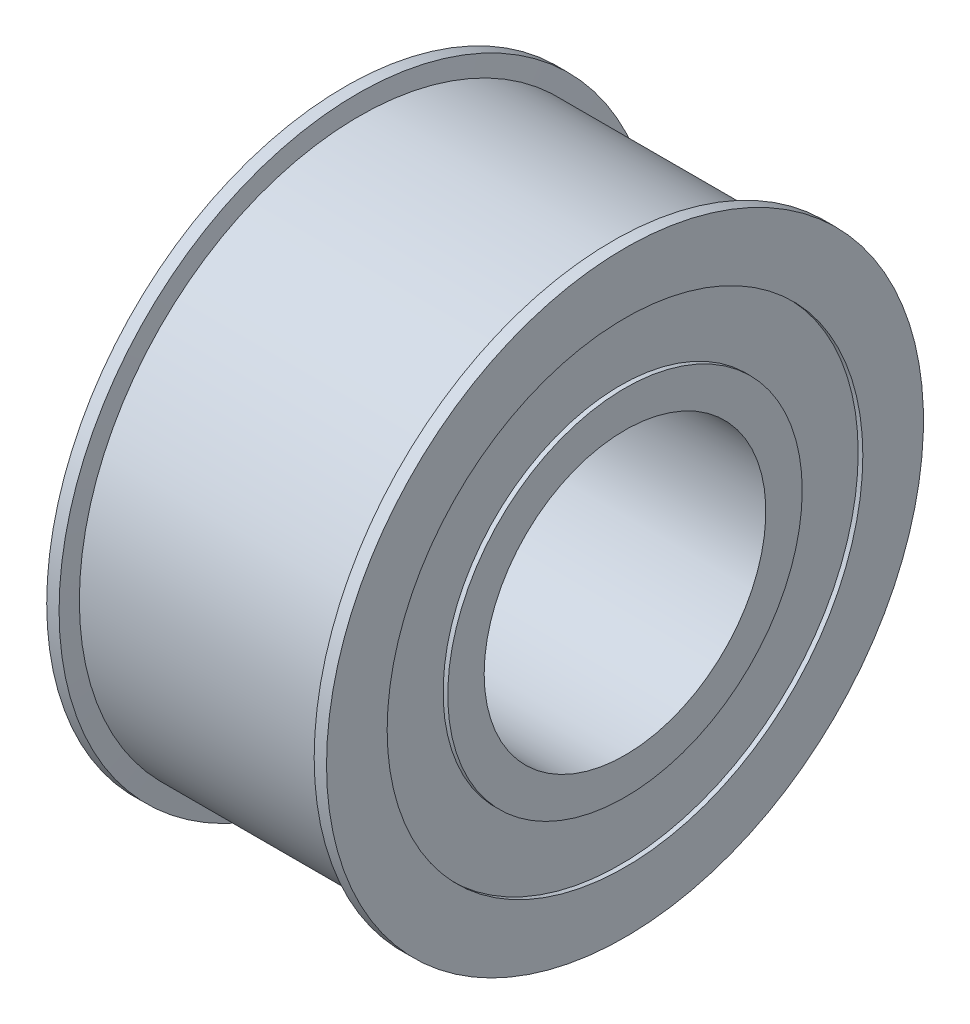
from build123d import *

# Parameters (mm, degrees)
SKETCH3_R          = 25.5
SKETCH3_R_2        = 19
CUT_EXTRUDE1_DEPTH = 0.5
CUT_EXTRUDE2_START = -0.5
SKETCH4_R          = 25.5
SKETCH4_R_2        = 19
CUT_EXTRUDE2_DEPTH = 0.5


with BuildPart() as part:
    # Sketch2 → Revolve1 (revolve)
    with BuildSketch(Plane.XY, mode=Mode.PRIVATE) as revolve1_sk:
        Polygon((15, 15.1), (15, 32), (13.674977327, 32), (13.5, 30), (-13.5, 30), (-13.674977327, 32), (-15, 32), (-15, 15.1), align=None)
    revolve(revolve1_sk.sketch.rotate(Axis((0, 0, 0), (1, 0, 0)), 90), axis=Axis((0, 0, 0), (1, 0, 0)))

    # Sketch3 → Cut-Extrude1 (cut)
    with BuildSketch(Plane(origin=(15, 0, 0), x_dir=(0, 0, -1), z_dir=(1, 0, 0))):
        Circle(SKETCH3_R)
        Circle(SKETCH3_R_2, mode=Mode.SUBTRACT)
    extrude(amount=-CUT_EXTRUDE1_DEPTH, mode=Mode.SUBTRACT)

    # Sketch4 → Cut-Extrude2 (cut)
    with BuildSketch(Plane.ZY.offset(15).offset(CUT_EXTRUDE2_START)):
        with Locations(Location((0, 0, 0), (0, 0, 180))):
            Circle(SKETCH4_R)
        with Locations(Location((0, 0, 0), (0, 0, 180))):
            Circle(SKETCH4_R_2, mode=Mode.SUBTRACT)
    extrude(amount=CUT_EXTRUDE2_DEPTH, mode=Mode.SUBTRACT)


solid = part.part
